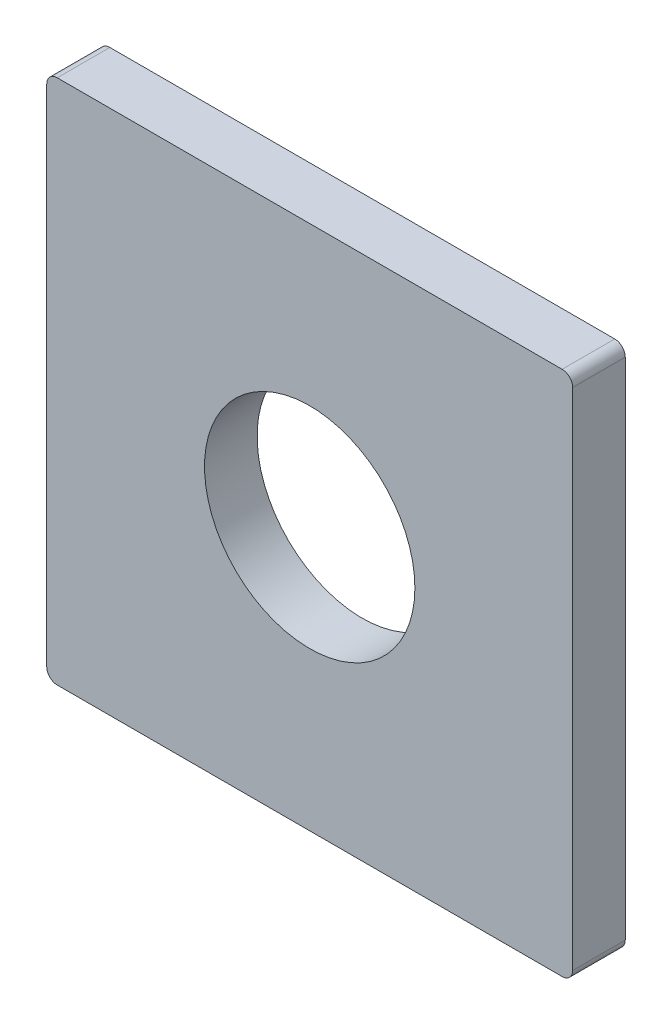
ISO-10303-21;
HEADER;
FILE_DESCRIPTION(('STEP AP214'),'2;1');
FILE_NAME('part.step','',(''),(''),'','','');
FILE_SCHEMA(('AUTOMOTIVE_DESIGN { 1 0 10303 214 1 1 1 1 }'));
ENDSEC;
DATA;
#1=APPLICATION_CONTEXT('core data for automotive mechanical design processes');
#2=APPLICATION_PROTOCOL_DEFINITION('international standard','automotive_design',2000,#1);
#3=PRODUCT_CONTEXT('',#1,'mechanical');
#4=PRODUCT('Part','Part','',(#3));
#5=PRODUCT_RELATED_PRODUCT_CATEGORY('part','',(#4));
#6=PRODUCT_DEFINITION_FORMATION('','',#4);
#7=PRODUCT_DEFINITION_CONTEXT('part definition',#1,'design');
#8=PRODUCT_DEFINITION('design','',#6,#7);
#9=PRODUCT_DEFINITION_SHAPE('','',#8);
#10=(LENGTH_UNIT() NAMED_UNIT(*) SI_UNIT(.MILLI.,.METRE.));
#11=(NAMED_UNIT(*) PLANE_ANGLE_UNIT() SI_UNIT($,.RADIAN.));
#12=(NAMED_UNIT(*) SI_UNIT($,.STERADIAN.) SOLID_ANGLE_UNIT());
#13=UNCERTAINTY_MEASURE_WITH_UNIT(LENGTH_MEASURE(1.E-05),#10,'distance_accuracy_value','');
#14=(GEOMETRIC_REPRESENTATION_CONTEXT(3) GLOBAL_UNCERTAINTY_ASSIGNED_CONTEXT((#13)) GLOBAL_UNIT_ASSIGNED_CONTEXT((#10,
#11,#12)) REPRESENTATION_CONTEXT('',''));
#15=CARTESIAN_POINT('',(0.,0.,0.));
#16=DIRECTION('',(0.,0.,1.));
#17=DIRECTION('',(1.,0.,0.));
#18=AXIS2_PLACEMENT_3D('',#15,#16,#17);
#19=CARTESIAN_POINT('',(0.,0.,0.25));
#20=DIRECTION('',(0.,0.,1.));
#21=DIRECTION('',(1.,0.,0.));
#22=AXIS2_PLACEMENT_3D('',#19,#20,#21);
#23=PLANE('',#22);
#24=CARTESIAN_POINT('',(0.,0.,0.25));
#25=DIRECTION('',(0.,0.,1.));
#26=DIRECTION('',(1.,0.,0.));
#27=AXIS2_PLACEMENT_3D('',#24,#25,#26);
#28=CIRCLE('',#27,1.);
#29=CARTESIAN_POINT('',(1.,0.,0.25));
#30=VERTEX_POINT('',#29);
#31=EDGE_CURVE('E127',#30,#30,#28,.F.);
#32=ORIENTED_EDGE('',*,*,#31,.T.);
#33=EDGE_LOOP('',(#32));
#34=FACE_BOUND('',#33,.T.);
#35=DIRECTION('',(1.,0.,0.));
#36=VECTOR('',#35,1.);
#37=CARTESIAN_POINT('',(2.5,2.5,0.25));
#38=LINE('',#37,#36);
#39=CARTESIAN_POINT('',(-2.4,2.5,0.25));
#40=VERTEX_POINT('',#39);
#41=CARTESIAN_POINT('',(2.4,2.5,0.25));
#42=VERTEX_POINT('',#41);
#43=EDGE_CURVE('E93',#40,#42,#38,.T.);
#44=ORIENTED_EDGE('',*,*,#43,.F.);
#45=CARTESIAN_POINT('',(-2.4,2.4,0.25));
#46=DIRECTION('',(0.,0.,-1.));
#47=DIRECTION('',(-1.,0.,0.));
#48=AXIS2_PLACEMENT_3D('',#45,#46,#47);
#49=CIRCLE('',#48,0.1);
#50=CARTESIAN_POINT('',(-2.5,2.4,0.25));
#51=VERTEX_POINT('',#50);
#52=EDGE_CURVE('E20',#51,#40,#49,.T.);
#53=ORIENTED_EDGE('',*,*,#52,.F.);
#54=DIRECTION('',(0.,1.,0.));
#55=VECTOR('',#54,1.);
#56=CARTESIAN_POINT('',(-2.5,2.5,0.25));
#57=LINE('',#56,#55);
#58=CARTESIAN_POINT('',(-2.5,-2.4,0.25));
#59=VERTEX_POINT('',#58);
#60=EDGE_CURVE('E79',#59,#51,#57,.T.);
#61=ORIENTED_EDGE('',*,*,#60,.F.);
#62=CARTESIAN_POINT('',(-2.4,-2.4,0.25));
#63=DIRECTION('',(0.,0.,-1.));
#64=DIRECTION('',(-1.,0.,0.));
#65=AXIS2_PLACEMENT_3D('',#62,#63,#64);
#66=CIRCLE('',#65,0.1);
#67=CARTESIAN_POINT('',(-2.4,-2.5,0.25));
#68=VERTEX_POINT('',#67);
#69=EDGE_CURVE('E100',#68,#59,#66,.T.);
#70=ORIENTED_EDGE('',*,*,#69,.F.);
#71=DIRECTION('',(1.,0.,0.));
#72=VECTOR('',#71,1.);
#73=CARTESIAN_POINT('',(-2.5,-2.5,0.25));
#74=LINE('',#73,#72);
#75=CARTESIAN_POINT('',(2.4,-2.5,0.25));
#76=VERTEX_POINT('',#75);
#77=EDGE_CURVE('E111',#76,#68,#74,.F.);
#78=ORIENTED_EDGE('',*,*,#77,.F.);
#79=CARTESIAN_POINT('',(2.4,-2.4,0.25));
#80=DIRECTION('',(0.,0.,-1.));
#81=DIRECTION('',(-1.,0.,0.));
#82=AXIS2_PLACEMENT_3D('',#79,#80,#81);
#83=CIRCLE('',#82,0.1);
#84=CARTESIAN_POINT('',(2.5,-2.4,0.25));
#85=VERTEX_POINT('',#84);
#86=EDGE_CURVE('E133',#85,#76,#83,.T.);
#87=ORIENTED_EDGE('',*,*,#86,.F.);
#88=DIRECTION('',(0.,1.,0.));
#89=VECTOR('',#88,1.);
#90=CARTESIAN_POINT('',(2.5,-2.5,0.25));
#91=LINE('',#90,#89);
#92=CARTESIAN_POINT('',(2.5,2.4,0.25));
#93=VERTEX_POINT('',#92);
#94=EDGE_CURVE('E107',#93,#85,#91,.F.);
#95=ORIENTED_EDGE('',*,*,#94,.F.);
#96=CARTESIAN_POINT('',(2.4,2.4,0.25));
#97=DIRECTION('',(0.,0.,-1.));
#98=DIRECTION('',(-1.,0.,0.));
#99=AXIS2_PLACEMENT_3D('',#96,#97,#98);
#100=CIRCLE('',#99,0.1);
#101=EDGE_CURVE('E131',#42,#93,#100,.T.);
#102=ORIENTED_EDGE('',*,*,#101,.F.);
#103=EDGE_LOOP('',(#44,#53,#61,#70,#78,#87,#95,#102));
#104=FACE_BOUND('',#103,.T.);
#105=ADVANCED_FACE('F17',(#34,#104),#23,.T.);
#106=CARTESIAN_POINT('',(-2.4,2.4,0.2621708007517));
#107=DIRECTION('',(0.,0.,-1.));
#108=DIRECTION('',(-1.,0.,0.));
#109=AXIS2_PLACEMENT_3D('',#106,#107,#108);
#110=CYLINDRICAL_SURFACE('',#109,0.1);
#111=DIRECTION('',(0.,0.,1.));
#112=VECTOR('',#111,1.);
#113=CARTESIAN_POINT('',(-2.4,2.5,-0.25));
#114=LINE('',#113,#112);
#115=CARTESIAN_POINT('',(-2.4,2.5,-0.25));
#116=VERTEX_POINT('',#115);
#117=EDGE_CURVE('E130',#116,#40,#114,.T.);
#118=ORIENTED_EDGE('',*,*,#117,.F.);
#119=CARTESIAN_POINT('',(-2.4,2.4,-0.25));
#120=DIRECTION('',(0.,0.,-1.));
#121=DIRECTION('',(-1.,0.,0.));
#122=AXIS2_PLACEMENT_3D('',#119,#120,#121);
#123=CIRCLE('',#122,0.1);
#124=CARTESIAN_POINT('',(-2.5,2.4,-0.25));
#125=VERTEX_POINT('',#124);
#126=EDGE_CURVE('E99',#116,#125,#123,.F.);
#127=ORIENTED_EDGE('',*,*,#126,.T.);
#128=DIRECTION('',(0.,0.,1.));
#129=VECTOR('',#128,1.);
#130=CARTESIAN_POINT('',(-2.5,2.4,-0.25));
#131=LINE('',#130,#129);
#132=EDGE_CURVE('E84',#51,#125,#131,.F.);
#133=ORIENTED_EDGE('',*,*,#132,.F.);
#134=ORIENTED_EDGE('',*,*,#52,.T.);
#135=EDGE_LOOP('',(#118,#127,#133,#134));
#136=FACE_BOUND('',#135,.T.);
#137=ADVANCED_FACE('F98',(#136),#110,.T.);
#138=CARTESIAN_POINT('',(-2.5,2.5,-0.25));
#139=DIRECTION('',(-1.,0.,0.));
#140=DIRECTION('',(0.,0.,1.));
#141=AXIS2_PLACEMENT_3D('',#138,#139,#140);
#142=PLANE('',#141);
#143=ORIENTED_EDGE('',*,*,#60,.T.);
#144=ORIENTED_EDGE('',*,*,#132,.T.);
#145=DIRECTION('',(0.,1.,0.));
#146=VECTOR('',#145,1.);
#147=CARTESIAN_POINT('',(-2.5,0.,-0.25));
#148=LINE('',#147,#146);
#149=CARTESIAN_POINT('',(-2.5,-2.4,-0.25));
#150=VERTEX_POINT('',#149);
#151=EDGE_CURVE('E125',#125,#150,#148,.F.);
#152=ORIENTED_EDGE('',*,*,#151,.T.);
#153=DIRECTION('',(0.,0.,-1.));
#154=VECTOR('',#153,1.);
#155=CARTESIAN_POINT('',(-2.5,-2.4,0.2621708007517));
#156=LINE('',#155,#154);
#157=EDGE_CURVE('E86',#59,#150,#156,.T.);
#158=ORIENTED_EDGE('',*,*,#157,.F.);
#159=EDGE_LOOP('',(#143,#144,#152,#158));
#160=FACE_BOUND('',#159,.T.);
#161=ADVANCED_FACE('F81',(#160),#142,.T.);
#162=CARTESIAN_POINT('',(-2.4,-2.4,0.2621708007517));
#163=DIRECTION('',(0.,0.,-1.));
#164=DIRECTION('',(-1.,0.,0.));
#165=AXIS2_PLACEMENT_3D('',#162,#163,#164);
#166=CYLINDRICAL_SURFACE('',#165,0.1);
#167=ORIENTED_EDGE('',*,*,#157,.T.);
#168=CARTESIAN_POINT('',(-2.4,-2.4,-0.25));
#169=DIRECTION('',(0.,0.,-1.));
#170=DIRECTION('',(-1.,0.,0.));
#171=AXIS2_PLACEMENT_3D('',#168,#169,#170);
#172=CIRCLE('',#171,0.1);
#173=CARTESIAN_POINT('',(-2.4,-2.5,-0.25));
#174=VERTEX_POINT('',#173);
#175=EDGE_CURVE('E122',#150,#174,#172,.F.);
#176=ORIENTED_EDGE('',*,*,#175,.T.);
#177=DIRECTION('',(0.,0.,-1.));
#178=VECTOR('',#177,1.);
#179=CARTESIAN_POINT('',(-2.4,-2.5,-0.25));
#180=LINE('',#179,#178);
#181=EDGE_CURVE('E112',#68,#174,#180,.T.);
#182=ORIENTED_EDGE('',*,*,#181,.F.);
#183=ORIENTED_EDGE('',*,*,#69,.T.);
#184=EDGE_LOOP('',(#167,#176,#182,#183));
#185=FACE_BOUND('',#184,.T.);
#186=ADVANCED_FACE('F169',(#185),#166,.T.);
#187=CARTESIAN_POINT('',(-2.5,-2.5,-0.25));
#188=DIRECTION('',(0.,-1.,0.));
#189=DIRECTION('',(0.,0.,-1.));
#190=AXIS2_PLACEMENT_3D('',#187,#188,#189);
#191=PLANE('',#190);
#192=ORIENTED_EDGE('',*,*,#77,.T.);
#193=ORIENTED_EDGE('',*,*,#181,.T.);
#194=DIRECTION('',(1.,0.,0.));
#195=VECTOR('',#194,1.);
#196=CARTESIAN_POINT('',(0.,-2.5,-0.25));
#197=LINE('',#196,#195);
#198=CARTESIAN_POINT('',(2.4,-2.5,-0.25));
#199=VERTEX_POINT('',#198);
#200=EDGE_CURVE('E121',#174,#199,#197,.T.);
#201=ORIENTED_EDGE('',*,*,#200,.T.);
#202=DIRECTION('',(0.,0.,-1.));
#203=VECTOR('',#202,1.);
#204=CARTESIAN_POINT('',(2.4,-2.5,0.2621708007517));
#205=LINE('',#204,#203);
#206=EDGE_CURVE('E110',#76,#199,#205,.T.);
#207=ORIENTED_EDGE('',*,*,#206,.F.);
#208=EDGE_LOOP('',(#192,#193,#201,#207));
#209=FACE_BOUND('',#208,.T.);
#210=ADVANCED_FACE('F166',(#209),#191,.T.);
#211=CARTESIAN_POINT('',(2.4,-2.4,0.2621708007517));
#212=DIRECTION('',(0.,0.,-1.));
#213=DIRECTION('',(-1.,0.,0.));
#214=AXIS2_PLACEMENT_3D('',#211,#212,#213);
#215=CYLINDRICAL_SURFACE('',#214,0.1);
#216=ORIENTED_EDGE('',*,*,#206,.T.);
#217=CARTESIAN_POINT('',(2.4,-2.4,-0.25));
#218=DIRECTION('',(0.,0.,-1.));
#219=DIRECTION('',(-1.,0.,0.));
#220=AXIS2_PLACEMENT_3D('',#217,#218,#219);
#221=CIRCLE('',#220,0.1);
#222=CARTESIAN_POINT('',(2.5,-2.4,-0.25));
#223=VERTEX_POINT('',#222);
#224=EDGE_CURVE('E118',#199,#223,#221,.F.);
#225=ORIENTED_EDGE('',*,*,#224,.T.);
#226=DIRECTION('',(0.,0.,-1.));
#227=VECTOR('',#226,1.);
#228=CARTESIAN_POINT('',(2.5,-2.4,-0.25));
#229=LINE('',#228,#227);
#230=EDGE_CURVE('E109',#85,#223,#229,.T.);
#231=ORIENTED_EDGE('',*,*,#230,.F.);
#232=ORIENTED_EDGE('',*,*,#86,.T.);
#233=EDGE_LOOP('',(#216,#225,#231,#232));
#234=FACE_BOUND('',#233,.T.);
#235=ADVANCED_FACE('F164',(#234),#215,.T.);
#236=CARTESIAN_POINT('',(2.5,-2.5,-0.25));
#237=DIRECTION('',(1.,0.,0.));
#238=DIRECTION('',(0.,0.,-1.));
#239=AXIS2_PLACEMENT_3D('',#236,#237,#238);
#240=PLANE('',#239);
#241=DIRECTION('',(0.,1.,0.));
#242=VECTOR('',#241,1.);
#243=CARTESIAN_POINT('',(2.5,0.,-0.25));
#244=LINE('',#243,#242);
#245=CARTESIAN_POINT('',(2.5,2.4,-0.25));
#246=VERTEX_POINT('',#245);
#247=EDGE_CURVE('E117',#223,#246,#244,.T.);
#248=ORIENTED_EDGE('',*,*,#247,.T.);
#249=DIRECTION('',(0.,0.,-1.));
#250=VECTOR('',#249,1.);
#251=CARTESIAN_POINT('',(2.5,2.4,0.2621708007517));
#252=LINE('',#251,#250);
#253=EDGE_CURVE('E106',#93,#246,#252,.T.);
#254=ORIENTED_EDGE('',*,*,#253,.F.);
#255=ORIENTED_EDGE('',*,*,#94,.T.);
#256=ORIENTED_EDGE('',*,*,#230,.T.);
#257=EDGE_LOOP('',(#248,#254,#255,#256));
#258=FACE_BOUND('',#257,.T.);
#259=ADVANCED_FACE('F162',(#258),#240,.T.);
#260=CARTESIAN_POINT('',(2.4,2.4,0.2621708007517));
#261=DIRECTION('',(0.,0.,-1.));
#262=DIRECTION('',(-1.,0.,0.));
#263=AXIS2_PLACEMENT_3D('',#260,#261,#262);
#264=CYLINDRICAL_SURFACE('',#263,0.1);
#265=ORIENTED_EDGE('',*,*,#253,.T.);
#266=CARTESIAN_POINT('',(2.4,2.4,-0.25));
#267=DIRECTION('',(0.,0.,-1.));
#268=DIRECTION('',(-1.,0.,0.));
#269=AXIS2_PLACEMENT_3D('',#266,#267,#268);
#270=CIRCLE('',#269,0.1);
#271=CARTESIAN_POINT('',(2.4,2.5,-0.25));
#272=VERTEX_POINT('',#271);
#273=EDGE_CURVE('E114',#246,#272,#270,.F.);
#274=ORIENTED_EDGE('',*,*,#273,.T.);
#275=DIRECTION('',(0.,0.,1.));
#276=VECTOR('',#275,1.);
#277=CARTESIAN_POINT('',(2.4,2.5,-0.25));
#278=LINE('',#277,#276);
#279=EDGE_CURVE('E35',#42,#272,#278,.F.);
#280=ORIENTED_EDGE('',*,*,#279,.F.);
#281=ORIENTED_EDGE('',*,*,#101,.T.);
#282=EDGE_LOOP('',(#265,#274,#280,#281));
#283=FACE_BOUND('',#282,.T.);
#284=ADVANCED_FACE('F158',(#283),#264,.T.);
#285=CARTESIAN_POINT('',(2.5,2.5,-0.25));
#286=DIRECTION('',(0.,1.,0.));
#287=DIRECTION('',(0.,0.,1.));
#288=AXIS2_PLACEMENT_3D('',#285,#286,#287);
#289=PLANE('',#288);
#290=DIRECTION('',(1.,0.,0.));
#291=VECTOR('',#290,1.);
#292=CARTESIAN_POINT('',(0.,2.5,-0.25));
#293=LINE('',#292,#291);
#294=EDGE_CURVE('E26',#272,#116,#293,.F.);
#295=ORIENTED_EDGE('',*,*,#294,.T.);
#296=ORIENTED_EDGE('',*,*,#117,.T.);
#297=ORIENTED_EDGE('',*,*,#43,.T.);
#298=ORIENTED_EDGE('',*,*,#279,.T.);
#299=EDGE_LOOP('',(#295,#296,#297,#298));
#300=FACE_BOUND('',#299,.T.);
#301=ADVANCED_FACE('F152',(#300),#289,.T.);
#302=CARTESIAN_POINT('',(0.,0.,-0.25));
#303=DIRECTION('',(0.,0.,1.));
#304=DIRECTION('',(1.,0.,0.));
#305=AXIS2_PLACEMENT_3D('',#302,#303,#304);
#306=CYLINDRICAL_SURFACE('',#305,1.);
#307=ORIENTED_EDGE('',*,*,#31,.F.);
#308=EDGE_LOOP('',(#307));
#309=FACE_BOUND('',#308,.T.);
#310=CARTESIAN_POINT('',(0.,0.,-0.25));
#311=DIRECTION('',(0.,0.,1.));
#312=DIRECTION('',(1.,0.,0.));
#313=AXIS2_PLACEMENT_3D('',#310,#311,#312);
#314=CIRCLE('',#313,1.);
#315=CARTESIAN_POINT('',(1.,0.,-0.25));
#316=VERTEX_POINT('',#315);
#317=EDGE_CURVE('E11',#316,#316,#314,.F.);
#318=ORIENTED_EDGE('',*,*,#317,.T.);
#319=EDGE_LOOP('',(#318));
#320=FACE_BOUND('',#319,.T.);
#321=ADVANCED_FACE('F180',(#309,#320),#306,.F.);
#322=CARTESIAN_POINT('',(0.,0.,-0.25));
#323=DIRECTION('',(0.,0.,1.));
#324=DIRECTION('',(1.,0.,0.));
#325=AXIS2_PLACEMENT_3D('',#322,#323,#324);
#326=PLANE('',#325);
#327=ORIENTED_EDGE('',*,*,#317,.F.);
#328=EDGE_LOOP('',(#327));
#329=FACE_BOUND('',#328,.T.);
#330=ORIENTED_EDGE('',*,*,#273,.F.);
#331=ORIENTED_EDGE('',*,*,#247,.F.);
#332=ORIENTED_EDGE('',*,*,#224,.F.);
#333=ORIENTED_EDGE('',*,*,#200,.F.);
#334=ORIENTED_EDGE('',*,*,#175,.F.);
#335=ORIENTED_EDGE('',*,*,#151,.F.);
#336=ORIENTED_EDGE('',*,*,#126,.F.);
#337=ORIENTED_EDGE('',*,*,#294,.F.);
#338=EDGE_LOOP('',(#330,#331,#332,#333,#334,#335,#336,#337));
#339=FACE_BOUND('',#338,.T.);
#340=ADVANCED_FACE('F155',(#329,#339),#326,.F.);
#341=CLOSED_SHELL('',(#105,#137,#161,#186,#210,#235,#259,#284,#301,#321,#340));
#342=MANIFOLD_SOLID_BREP('B1',#341);
#343=ADVANCED_BREP_SHAPE_REPRESENTATION('',(#18,#342),#14);
#344=SHAPE_DEFINITION_REPRESENTATION(#9,#343);
ENDSEC;
END-ISO-10303-21;
